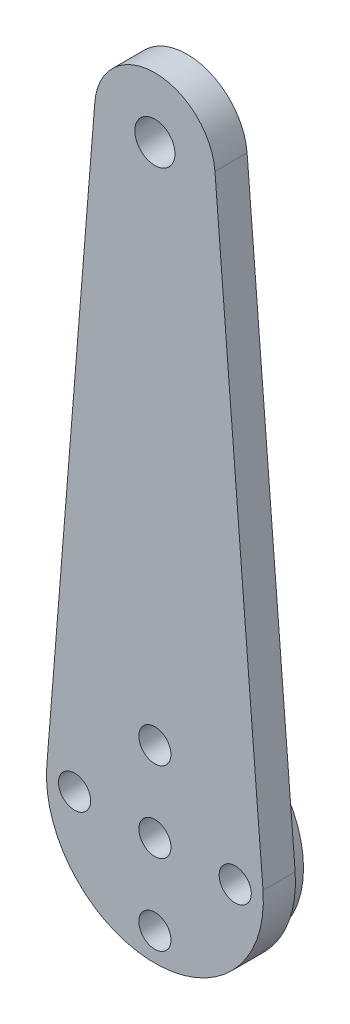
ISO-10303-21;
HEADER;
FILE_DESCRIPTION(('STEP AP214'),'2;1');
FILE_NAME('part.step','',(''),(''),'','','');
FILE_SCHEMA(('AUTOMOTIVE_DESIGN { 1 0 10303 214 1 1 1 1 }'));
ENDSEC;
DATA;
#1=APPLICATION_CONTEXT('core data for automotive mechanical design processes');
#2=APPLICATION_PROTOCOL_DEFINITION('international standard','automotive_design',2000,#1);
#3=PRODUCT_CONTEXT('',#1,'mechanical');
#4=PRODUCT('Part','Part','',(#3));
#5=PRODUCT_RELATED_PRODUCT_CATEGORY('part','',(#4));
#6=PRODUCT_DEFINITION_FORMATION('','',#4);
#7=PRODUCT_DEFINITION_CONTEXT('part definition',#1,'design');
#8=PRODUCT_DEFINITION('design','',#6,#7);
#9=PRODUCT_DEFINITION_SHAPE('','',#8);
#10=(LENGTH_UNIT() NAMED_UNIT(*) SI_UNIT(.MILLI.,.METRE.));
#11=(NAMED_UNIT(*) PLANE_ANGLE_UNIT() SI_UNIT($,.RADIAN.));
#12=(NAMED_UNIT(*) SI_UNIT($,.STERADIAN.) SOLID_ANGLE_UNIT());
#13=UNCERTAINTY_MEASURE_WITH_UNIT(LENGTH_MEASURE(1.E-05),#10,'distance_accuracy_value','');
#14=(GEOMETRIC_REPRESENTATION_CONTEXT(3) GLOBAL_UNCERTAINTY_ASSIGNED_CONTEXT((#13)) GLOBAL_UNIT_ASSIGNED_CONTEXT((#10,
#11,#12)) REPRESENTATION_CONTEXT('',''));
#15=CARTESIAN_POINT('',(0.,0.,0.));
#16=DIRECTION('',(0.,0.,1.));
#17=DIRECTION('',(1.,0.,0.));
#18=AXIS2_PLACEMENT_3D('',#15,#16,#17);
#19=CARTESIAN_POINT('',(0.,75.,6.));
#20=DIRECTION('',(0.,0.,1.));
#21=DIRECTION('',(1.,0.,0.));
#22=AXIS2_PLACEMENT_3D('',#19,#20,#21);
#23=PLANE('',#22);
#24=CARTESIAN_POINT('',(0.,75.,6.));
#25=DIRECTION('',(0.,0.,1.));
#26=DIRECTION('',(1.,0.,0.));
#27=AXIS2_PLACEMENT_3D('',#24,#25,#26);
#28=CIRCLE('',#27,2.5);
#29=CARTESIAN_POINT('',(2.5,75.,6.));
#30=VERTEX_POINT('',#29);
#31=EDGE_CURVE('E287',#30,#30,#28,.T.);
#32=ORIENTED_EDGE('',*,*,#31,.F.);
#33=EDGE_LOOP('',(#32));
#34=FACE_BOUND('',#33,.T.);
#35=CARTESIAN_POINT('',(-10.,0.,6.));
#36=DIRECTION('',(0.,0.,1.));
#37=DIRECTION('',(1.,0.,0.));
#38=AXIS2_PLACEMENT_3D('',#35,#36,#37);
#39=CIRCLE('',#38,2.);
#40=CARTESIAN_POINT('',(-8.,0.,6.));
#41=VERTEX_POINT('',#40);
#42=EDGE_CURVE('E141',#41,#41,#39,.T.);
#43=ORIENTED_EDGE('',*,*,#42,.F.);
#44=EDGE_LOOP('',(#43));
#45=FACE_BOUND('',#44,.T.);
#46=CARTESIAN_POINT('',(10.,0.,6.));
#47=DIRECTION('',(0.,0.,1.));
#48=DIRECTION('',(1.,0.,0.));
#49=AXIS2_PLACEMENT_3D('',#46,#47,#48);
#50=CIRCLE('',#49,2.);
#51=CARTESIAN_POINT('',(12.,0.,6.));
#52=VERTEX_POINT('',#51);
#53=EDGE_CURVE('E142',#52,#52,#50,.T.);
#54=ORIENTED_EDGE('',*,*,#53,.F.);
#55=EDGE_LOOP('',(#54));
#56=FACE_BOUND('',#55,.T.);
#57=CARTESIAN_POINT('',(0.,75.,6.));
#58=DIRECTION('',(0.,0.,1.));
#59=DIRECTION('',(1.,0.,0.));
#60=AXIS2_PLACEMENT_3D('',#57,#58,#59);
#61=CIRCLE('',#60,7.5);
#62=CARTESIAN_POINT('',(7.47596147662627,75.6,6.));
#63=VERTEX_POINT('',#62);
#64=CARTESIAN_POINT('',(-7.47596147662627,75.6,6.));
#65=VERTEX_POINT('',#64);
#66=EDGE_CURVE('E104',#63,#65,#61,.T.);
#67=ORIENTED_EDGE('',*,*,#66,.T.);
#68=DIRECTION('',(-0.08,-0.996794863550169,0.));
#69=VECTOR('',#68,1.);
#70=CARTESIAN_POINT('',(-7.47596147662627,75.6,6.));
#71=LINE('',#70,#69);
#72=CARTESIAN_POINT('',(-13.4567306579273,1.08,6.));
#73=VERTEX_POINT('',#72);
#74=EDGE_CURVE('E99',#65,#73,#71,.T.);
#75=ORIENTED_EDGE('',*,*,#74,.T.);
#76=CARTESIAN_POINT('',(0.,0.,6.));
#77=DIRECTION('',(0.,0.,1.));
#78=DIRECTION('',(1.,0.,0.));
#79=AXIS2_PLACEMENT_3D('',#76,#77,#78);
#80=CIRCLE('',#79,13.5);
#81=CARTESIAN_POINT('',(13.4567306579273,1.08,6.));
#82=VERTEX_POINT('',#81);
#83=EDGE_CURVE('E102',#73,#82,#80,.T.);
#84=ORIENTED_EDGE('',*,*,#83,.T.);
#85=DIRECTION('',(-0.08,0.996794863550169,0.));
#86=VECTOR('',#85,1.);
#87=CARTESIAN_POINT('',(7.47596147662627,75.6,6.));
#88=LINE('',#87,#86);
#89=EDGE_CURVE('E69',#82,#63,#88,.T.);
#90=ORIENTED_EDGE('',*,*,#89,.T.);
#91=EDGE_LOOP('',(#67,#75,#84,#90));
#92=FACE_BOUND('',#91,.T.);
#93=CARTESIAN_POINT('',(0.,-10.,6.));
#94=DIRECTION('',(0.,0.,1.));
#95=DIRECTION('',(1.,0.,0.));
#96=AXIS2_PLACEMENT_3D('',#93,#94,#95);
#97=CIRCLE('',#96,2.);
#98=CARTESIAN_POINT('',(2.,-10.,6.));
#99=VERTEX_POINT('',#98);
#100=EDGE_CURVE('E129',#99,#99,#97,.T.);
#101=ORIENTED_EDGE('',*,*,#100,.F.);
#102=EDGE_LOOP('',(#101));
#103=FACE_BOUND('',#102,.T.);
#104=CARTESIAN_POINT('',(0.,10.,6.));
#105=DIRECTION('',(0.,0.,1.));
#106=DIRECTION('',(1.,0.,0.));
#107=AXIS2_PLACEMENT_3D('',#104,#105,#106);
#108=CIRCLE('',#107,2.);
#109=CARTESIAN_POINT('',(2.,10.,6.));
#110=VERTEX_POINT('',#109);
#111=EDGE_CURVE('E294',#110,#110,#108,.T.);
#112=ORIENTED_EDGE('',*,*,#111,.F.);
#113=EDGE_LOOP('',(#112));
#114=FACE_BOUND('',#113,.T.);
#115=CARTESIAN_POINT('',(0.,0.,6.));
#116=DIRECTION('',(0.,0.,1.));
#117=DIRECTION('',(1.,0.,0.));
#118=AXIS2_PLACEMENT_3D('',#115,#116,#117);
#119=CIRCLE('',#118,2.);
#120=CARTESIAN_POINT('',(2.,0.,6.));
#121=VERTEX_POINT('',#120);
#122=EDGE_CURVE('E277',#121,#121,#119,.T.);
#123=ORIENTED_EDGE('',*,*,#122,.F.);
#124=EDGE_LOOP('',(#123));
#125=FACE_BOUND('',#124,.T.);
#126=ADVANCED_FACE('F52',(#34,#45,#56,#92,#103,#114,#125),#23,.T.);
#127=CARTESIAN_POINT('',(0.,75.,2.));
#128=DIRECTION('',(0.,0.,1.));
#129=DIRECTION('',(1.,0.,0.));
#130=AXIS2_PLACEMENT_3D('',#127,#128,#129);
#131=PLANE('',#130);
#132=CARTESIAN_POINT('',(0.,75.,2.));
#133=DIRECTION('',(0.,0.,1.));
#134=DIRECTION('',(1.,0.,0.));
#135=AXIS2_PLACEMENT_3D('',#132,#133,#134);
#136=CIRCLE('',#135,7.5);
#137=CARTESIAN_POINT('',(7.47596147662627,75.6,2.));
#138=VERTEX_POINT('',#137);
#139=CARTESIAN_POINT('',(-7.47596147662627,75.6,2.));
#140=VERTEX_POINT('',#139);
#141=EDGE_CURVE('E147',#138,#140,#136,.T.);
#142=ORIENTED_EDGE('',*,*,#141,.F.);
#143=DIRECTION('',(-0.08,0.996794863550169,0.));
#144=VECTOR('',#143,1.);
#145=CARTESIAN_POINT('',(7.47596147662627,75.6,2.));
#146=LINE('',#145,#144);
#147=CARTESIAN_POINT('',(13.4567306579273,1.08,2.));
#148=VERTEX_POINT('',#147);
#149=EDGE_CURVE('E92',#148,#138,#146,.T.);
#150=ORIENTED_EDGE('',*,*,#149,.F.);
#151=CARTESIAN_POINT('',(0.,0.,2.));
#152=DIRECTION('',(0.,0.,1.));
#153=DIRECTION('',(1.,0.,0.));
#154=AXIS2_PLACEMENT_3D('',#151,#152,#153);
#155=CIRCLE('',#154,13.5);
#156=CARTESIAN_POINT('',(-13.4567306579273,1.08,2.));
#157=VERTEX_POINT('',#156);
#158=EDGE_CURVE('E86',#157,#148,#155,.T.);
#159=ORIENTED_EDGE('',*,*,#158,.F.);
#160=DIRECTION('',(-0.08,-0.996794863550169,0.));
#161=VECTOR('',#160,1.);
#162=CARTESIAN_POINT('',(-7.47596147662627,75.6,2.));
#163=LINE('',#162,#161);
#164=EDGE_CURVE('E109',#140,#157,#163,.T.);
#165=ORIENTED_EDGE('',*,*,#164,.F.);
#166=EDGE_LOOP('',(#142,#150,#159,#165));
#167=FACE_BOUND('',#166,.T.);
#168=CARTESIAN_POINT('',(10.,0.,2.));
#169=DIRECTION('',(0.,0.,1.));
#170=DIRECTION('',(1.,0.,0.));
#171=AXIS2_PLACEMENT_3D('',#168,#169,#170);
#172=CIRCLE('',#171,2.);
#173=CARTESIAN_POINT('',(12.,0.,2.));
#174=VERTEX_POINT('',#173);
#175=EDGE_CURVE('E135',#174,#174,#172,.T.);
#176=ORIENTED_EDGE('',*,*,#175,.T.);
#177=EDGE_LOOP('',(#176));
#178=FACE_BOUND('',#177,.T.);
#179=CARTESIAN_POINT('',(0.,-10.,2.));
#180=DIRECTION('',(0.,0.,1.));
#181=DIRECTION('',(1.,0.,0.));
#182=AXIS2_PLACEMENT_3D('',#179,#180,#181);
#183=CIRCLE('',#182,2.);
#184=CARTESIAN_POINT('',(2.,-10.,2.));
#185=VERTEX_POINT('',#184);
#186=EDGE_CURVE('E136',#185,#185,#183,.T.);
#187=ORIENTED_EDGE('',*,*,#186,.T.);
#188=EDGE_LOOP('',(#187));
#189=FACE_BOUND('',#188,.T.);
#190=CARTESIAN_POINT('',(-10.,0.,2.));
#191=DIRECTION('',(0.,0.,1.));
#192=DIRECTION('',(1.,0.,0.));
#193=AXIS2_PLACEMENT_3D('',#190,#191,#192);
#194=CIRCLE('',#193,2.);
#195=CARTESIAN_POINT('',(-8.,0.,2.));
#196=VERTEX_POINT('',#195);
#197=EDGE_CURVE('E137',#196,#196,#194,.T.);
#198=ORIENTED_EDGE('',*,*,#197,.T.);
#199=EDGE_LOOP('',(#198));
#200=FACE_BOUND('',#199,.T.);
#201=CARTESIAN_POINT('',(0.,10.,2.));
#202=DIRECTION('',(0.,0.,1.));
#203=DIRECTION('',(1.,0.,0.));
#204=AXIS2_PLACEMENT_3D('',#201,#202,#203);
#205=CIRCLE('',#204,2.);
#206=CARTESIAN_POINT('',(2.,10.,2.));
#207=VERTEX_POINT('',#206);
#208=EDGE_CURVE('E292',#207,#207,#205,.T.);
#209=ORIENTED_EDGE('',*,*,#208,.T.);
#210=EDGE_LOOP('',(#209));
#211=FACE_BOUND('',#210,.T.);
#212=CARTESIAN_POINT('',(0.,75.,2.));
#213=DIRECTION('',(0.,0.,1.));
#214=DIRECTION('',(1.,0.,0.));
#215=AXIS2_PLACEMENT_3D('',#212,#213,#214);
#216=CIRCLE('',#215,2.5);
#217=CARTESIAN_POINT('',(2.5,75.,2.));
#218=VERTEX_POINT('',#217);
#219=EDGE_CURVE('E284',#218,#218,#216,.T.);
#220=ORIENTED_EDGE('',*,*,#219,.T.);
#221=EDGE_LOOP('',(#220));
#222=FACE_BOUND('',#221,.T.);
#223=CARTESIAN_POINT('',(0.,0.,2.));
#224=DIRECTION('',(0.,0.,1.));
#225=DIRECTION('',(1.,0.,0.));
#226=AXIS2_PLACEMENT_3D('',#223,#224,#225);
#227=CIRCLE('',#226,2.);
#228=CARTESIAN_POINT('',(2.,0.,2.));
#229=VERTEX_POINT('',#228);
#230=EDGE_CURVE('E280',#229,#229,#227,.T.);
#231=ORIENTED_EDGE('',*,*,#230,.T.);
#232=EDGE_LOOP('',(#231));
#233=FACE_BOUND('',#232,.T.);
#234=ADVANCED_FACE('F161',(#167,#178,#189,#200,#211,#222,#233),#131,.F.);
#235=CARTESIAN_POINT('',(0.,75.,6.));
#236=DIRECTION('',(0.,0.,-1.));
#237=DIRECTION('',(-1.,0.,0.));
#238=AXIS2_PLACEMENT_3D('',#235,#236,#237);
#239=CYLINDRICAL_SURFACE('',#238,7.5);
#240=ORIENTED_EDGE('',*,*,#141,.T.);
#241=DIRECTION('',(0.,0.,-1.));
#242=VECTOR('',#241,1.);
#243=CARTESIAN_POINT('',(-7.47596147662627,75.6,6.));
#244=LINE('',#243,#242);
#245=EDGE_CURVE('E13',#65,#140,#244,.T.);
#246=ORIENTED_EDGE('',*,*,#245,.F.);
#247=ORIENTED_EDGE('',*,*,#66,.F.);
#248=DIRECTION('',(0.,0.,-1.));
#249=VECTOR('',#248,1.);
#250=CARTESIAN_POINT('',(7.47596147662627,75.6,6.));
#251=LINE('',#250,#249);
#252=EDGE_CURVE('E115',#63,#138,#251,.T.);
#253=ORIENTED_EDGE('',*,*,#252,.T.);
#254=EDGE_LOOP('',(#240,#246,#247,#253));
#255=FACE_BOUND('',#254,.T.);
#256=ADVANCED_FACE('F54',(#255),#239,.T.);
#257=CARTESIAN_POINT('',(-7.47596147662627,75.6,6.));
#258=DIRECTION('',(0.996794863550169,-0.08,0.));
#259=DIRECTION('',(0.08,0.996794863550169,0.));
#260=AXIS2_PLACEMENT_3D('',#257,#258,#259);
#261=PLANE('',#260);
#262=ORIENTED_EDGE('',*,*,#164,.T.);
#263=DIRECTION('',(0.,0.,-1.));
#264=VECTOR('',#263,1.);
#265=CARTESIAN_POINT('',(-13.4567306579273,1.08,6.));
#266=LINE('',#265,#264);
#267=EDGE_CURVE('E61',#73,#157,#266,.T.);
#268=ORIENTED_EDGE('',*,*,#267,.F.);
#269=ORIENTED_EDGE('',*,*,#74,.F.);
#270=ORIENTED_EDGE('',*,*,#245,.T.);
#271=EDGE_LOOP('',(#262,#268,#269,#270));
#272=FACE_BOUND('',#271,.T.);
#273=ADVANCED_FACE('F108',(#272),#261,.F.);
#274=CARTESIAN_POINT('',(0.,0.,6.));
#275=DIRECTION('',(0.,0.,-1.));
#276=DIRECTION('',(-1.,0.,0.));
#277=AXIS2_PLACEMENT_3D('',#274,#275,#276);
#278=CYLINDRICAL_SURFACE('',#277,13.5);
#279=ORIENTED_EDGE('',*,*,#158,.T.);
#280=DIRECTION('',(0.,0.,-1.));
#281=VECTOR('',#280,1.);
#282=CARTESIAN_POINT('',(13.4567306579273,1.08,6.));
#283=LINE('',#282,#281);
#284=EDGE_CURVE('E110',#82,#148,#283,.T.);
#285=ORIENTED_EDGE('',*,*,#284,.F.);
#286=ORIENTED_EDGE('',*,*,#83,.F.);
#287=ORIENTED_EDGE('',*,*,#267,.T.);
#288=EDGE_LOOP('',(#279,#285,#286,#287));
#289=FACE_BOUND('',#288,.T.);
#290=ADVANCED_FACE('F111',(#289),#278,.T.);
#291=CARTESIAN_POINT('',(7.47596147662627,75.6,6.));
#292=DIRECTION('',(-0.996794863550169,-0.08,0.));
#293=DIRECTION('',(0.08,-0.996794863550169,0.));
#294=AXIS2_PLACEMENT_3D('',#291,#292,#293);
#295=PLANE('',#294);
#296=ORIENTED_EDGE('',*,*,#149,.T.);
#297=ORIENTED_EDGE('',*,*,#252,.F.);
#298=ORIENTED_EDGE('',*,*,#89,.F.);
#299=ORIENTED_EDGE('',*,*,#284,.T.);
#300=EDGE_LOOP('',(#296,#297,#298,#299));
#301=FACE_BOUND('',#300,.T.);
#302=ADVANCED_FACE('F158',(#301),#295,.F.);
#303=CARTESIAN_POINT('',(10.,0.,6.));
#304=DIRECTION('',(0.,0.,-1.));
#305=DIRECTION('',(-1.,0.,0.));
#306=AXIS2_PLACEMENT_3D('',#303,#304,#305);
#307=CYLINDRICAL_SURFACE('',#306,2.);
#308=ORIENTED_EDGE('',*,*,#53,.T.);
#309=EDGE_LOOP('',(#308));
#310=FACE_BOUND('',#309,.T.);
#311=ORIENTED_EDGE('',*,*,#175,.F.);
#312=EDGE_LOOP('',(#311));
#313=FACE_BOUND('',#312,.T.);
#314=ADVANCED_FACE('F179',(#310,#313),#307,.F.);
#315=CARTESIAN_POINT('',(0.,-10.,6.));
#316=DIRECTION('',(0.,0.,-1.));
#317=DIRECTION('',(-1.,0.,0.));
#318=AXIS2_PLACEMENT_3D('',#315,#316,#317);
#319=CYLINDRICAL_SURFACE('',#318,2.);
#320=ORIENTED_EDGE('',*,*,#100,.T.);
#321=EDGE_LOOP('',(#320));
#322=FACE_BOUND('',#321,.T.);
#323=ORIENTED_EDGE('',*,*,#186,.F.);
#324=EDGE_LOOP('',(#323));
#325=FACE_BOUND('',#324,.T.);
#326=ADVANCED_FACE('F199',(#322,#325),#319,.F.);
#327=CARTESIAN_POINT('',(-10.,0.,6.));
#328=DIRECTION('',(0.,0.,-1.));
#329=DIRECTION('',(-1.,0.,0.));
#330=AXIS2_PLACEMENT_3D('',#327,#328,#329);
#331=CYLINDRICAL_SURFACE('',#330,2.);
#332=ORIENTED_EDGE('',*,*,#42,.T.);
#333=EDGE_LOOP('',(#332));
#334=FACE_BOUND('',#333,.T.);
#335=ORIENTED_EDGE('',*,*,#197,.F.);
#336=EDGE_LOOP('',(#335));
#337=FACE_BOUND('',#336,.T.);
#338=ADVANCED_FACE('F206',(#334,#337),#331,.F.);
#339=CARTESIAN_POINT('',(0.,10.,6.));
#340=DIRECTION('',(0.,0.,-1.));
#341=DIRECTION('',(-1.,0.,0.));
#342=AXIS2_PLACEMENT_3D('',#339,#340,#341);
#343=CYLINDRICAL_SURFACE('',#342,2.);
#344=ORIENTED_EDGE('',*,*,#111,.T.);
#345=EDGE_LOOP('',(#344));
#346=FACE_BOUND('',#345,.T.);
#347=ORIENTED_EDGE('',*,*,#208,.F.);
#348=EDGE_LOOP('',(#347));
#349=FACE_BOUND('',#348,.T.);
#350=ADVANCED_FACE('F213',(#346,#349),#343,.F.);
#351=CARTESIAN_POINT('',(0.,75.,6.));
#352=DIRECTION('',(0.,0.,-1.));
#353=DIRECTION('',(-1.,0.,0.));
#354=AXIS2_PLACEMENT_3D('',#351,#352,#353);
#355=CYLINDRICAL_SURFACE('',#354,2.5);
#356=ORIENTED_EDGE('',*,*,#31,.T.);
#357=EDGE_LOOP('',(#356));
#358=FACE_BOUND('',#357,.T.);
#359=ORIENTED_EDGE('',*,*,#219,.F.);
#360=EDGE_LOOP('',(#359));
#361=FACE_BOUND('',#360,.T.);
#362=ADVANCED_FACE('F221',(#358,#361),#355,.F.);
#363=CARTESIAN_POINT('',(0.,0.,6.));
#364=DIRECTION('',(0.,0.,-1.));
#365=DIRECTION('',(-1.,0.,0.));
#366=AXIS2_PLACEMENT_3D('',#363,#364,#365);
#367=CYLINDRICAL_SURFACE('',#366,2.);
#368=ORIENTED_EDGE('',*,*,#122,.T.);
#369=EDGE_LOOP('',(#368));
#370=FACE_BOUND('',#369,.T.);
#371=ORIENTED_EDGE('',*,*,#230,.F.);
#372=EDGE_LOOP('',(#371));
#373=FACE_BOUND('',#372,.T.);
#374=ADVANCED_FACE('F229',(#370,#373),#367,.F.);
#375=CLOSED_SHELL('',(#126,#234,#256,#273,#290,#302,#314,#326,#338,#350,#362,#374));
#376=MANIFOLD_SOLID_BREP('B2',#375);
#377=CARTESIAN_POINT('',(0.,0.,0.));
#378=DIRECTION('',(0.,0.,1.));
#379=DIRECTION('',(1.,0.,0.));
#380=AXIS2_PLACEMENT_3D('',#377,#378,#379);
#381=PLANE('',#380);
#382=CARTESIAN_POINT('',(0.,0.,0.));
#383=DIRECTION('',(0.,0.,1.));
#384=DIRECTION('',(1.,0.,0.));
#385=AXIS2_PLACEMENT_3D('',#382,#383,#384);
#386=CIRCLE('',#385,2.);
#387=CARTESIAN_POINT('',(2.,0.,0.));
#388=VERTEX_POINT('',#387);
#389=EDGE_CURVE('E362',#388,#388,#386,.T.);
#390=ORIENTED_EDGE('',*,*,#389,.T.);
#391=EDGE_LOOP('',(#390));
#392=FACE_BOUND('',#391,.T.);
#393=CARTESIAN_POINT('',(0.,0.,0.));
#394=DIRECTION('',(0.,0.,-1.));
#395=DIRECTION('',(-1.,0.,0.));
#396=AXIS2_PLACEMENT_3D('',#393,#394,#395);
#397=CIRCLE('',#396,3.5);
#398=CARTESIAN_POINT('',(-3.5,0.,0.));
#399=VERTEX_POINT('',#398);
#400=EDGE_CURVE('E407',#399,#399,#397,.T.);
#401=ORIENTED_EDGE('',*,*,#400,.T.);
#402=EDGE_LOOP('',(#401));
#403=FACE_BOUND('',#402,.T.);
#404=ADVANCED_FACE('F329',(#392,#403),#381,.F.);
#405=CARTESIAN_POINT('',(0.,0.,2.));
#406=DIRECTION('',(0.,0.,-1.));
#407=DIRECTION('',(-1.,0.,0.));
#408=AXIS2_PLACEMENT_3D('',#405,#406,#407);
#409=CYLINDRICAL_SURFACE('',#408,2.);
#410=CARTESIAN_POINT('',(0.,0.,2.));
#411=DIRECTION('',(0.,0.,1.));
#412=DIRECTION('',(1.,0.,0.));
#413=AXIS2_PLACEMENT_3D('',#410,#411,#412);
#414=CIRCLE('',#413,2.);
#415=CARTESIAN_POINT('',(2.,0.,2.));
#416=VERTEX_POINT('',#415);
#417=EDGE_CURVE('E340',#416,#416,#414,.T.);
#418=ORIENTED_EDGE('',*,*,#417,.T.);
#419=EDGE_LOOP('',(#418));
#420=FACE_BOUND('',#419,.T.);
#421=ORIENTED_EDGE('',*,*,#389,.F.);
#422=EDGE_LOOP('',(#421));
#423=FACE_BOUND('',#422,.T.);
#424=ADVANCED_FACE('F396',(#420,#423),#409,.F.);
#425=CARTESIAN_POINT('',(0.,10.,2.));
#426=DIRECTION('',(0.,0.,-1.));
#427=DIRECTION('',(-1.,0.,0.));
#428=AXIS2_PLACEMENT_3D('',#425,#426,#427);
#429=CYLINDRICAL_SURFACE('',#428,2.);
#430=CARTESIAN_POINT('',(0.,10.,2.));
#431=DIRECTION('',(0.,0.,1.));
#432=DIRECTION('',(1.,0.,0.));
#433=AXIS2_PLACEMENT_3D('',#430,#431,#432);
#434=CIRCLE('',#433,2.);
#435=CARTESIAN_POINT('',(2.,10.,2.));
#436=VERTEX_POINT('',#435);
#437=EDGE_CURVE('E345',#436,#436,#434,.T.);
#438=ORIENTED_EDGE('',*,*,#437,.T.);
#439=EDGE_LOOP('',(#438));
#440=FACE_BOUND('',#439,.T.);
#441=CARTESIAN_POINT('',(0.,10.,0.));
#442=DIRECTION('',(0.,0.,1.));
#443=DIRECTION('',(1.,0.,0.));
#444=AXIS2_PLACEMENT_3D('',#441,#442,#443);
#445=CIRCLE('',#444,2.);
#446=CARTESIAN_POINT('',(2.,10.,0.));
#447=VERTEX_POINT('',#446);
#448=EDGE_CURVE('E359',#447,#447,#445,.T.);
#449=ORIENTED_EDGE('',*,*,#448,.F.);
#450=EDGE_LOOP('',(#449));
#451=FACE_BOUND('',#450,.T.);
#452=ADVANCED_FACE('F384',(#440,#451),#429,.F.);
#453=CARTESIAN_POINT('',(10.,0.,2.));
#454=DIRECTION('',(0.,0.,-1.));
#455=DIRECTION('',(-1.,0.,0.));
#456=AXIS2_PLACEMENT_3D('',#453,#454,#455);
#457=CYLINDRICAL_SURFACE('',#456,2.);
#458=CARTESIAN_POINT('',(10.,0.,2.));
#459=DIRECTION('',(0.,0.,1.));
#460=DIRECTION('',(1.,0.,0.));
#461=AXIS2_PLACEMENT_3D('',#458,#459,#460);
#462=CIRCLE('',#461,2.);
#463=CARTESIAN_POINT('',(12.,0.,2.));
#464=VERTEX_POINT('',#463);
#465=EDGE_CURVE('E375',#464,#464,#462,.T.);
#466=ORIENTED_EDGE('',*,*,#465,.T.);
#467=EDGE_LOOP('',(#466));
#468=FACE_BOUND('',#467,.T.);
#469=CARTESIAN_POINT('',(10.,0.,0.));
#470=DIRECTION('',(0.,0.,1.));
#471=DIRECTION('',(1.,0.,0.));
#472=AXIS2_PLACEMENT_3D('',#469,#470,#471);
#473=CIRCLE('',#472,2.);
#474=CARTESIAN_POINT('',(12.,0.,0.));
#475=VERTEX_POINT('',#474);
#476=EDGE_CURVE('E356',#475,#475,#473,.T.);
#477=ORIENTED_EDGE('',*,*,#476,.F.);
#478=EDGE_LOOP('',(#477));
#479=FACE_BOUND('',#478,.T.);
#480=ADVANCED_FACE('F438',(#468,#479),#457,.F.);
#481=CARTESIAN_POINT('',(0.,-10.,2.));
#482=DIRECTION('',(0.,0.,-1.));
#483=DIRECTION('',(-1.,0.,0.));
#484=AXIS2_PLACEMENT_3D('',#481,#482,#483);
#485=CYLINDRICAL_SURFACE('',#484,2.);
#486=CARTESIAN_POINT('',(0.,-10.,2.));
#487=DIRECTION('',(0.,0.,1.));
#488=DIRECTION('',(1.,0.,0.));
#489=AXIS2_PLACEMENT_3D('',#486,#487,#488);
#490=CIRCLE('',#489,2.);
#491=CARTESIAN_POINT('',(2.,-10.,2.));
#492=VERTEX_POINT('',#491);
#493=EDGE_CURVE('E370',#492,#492,#490,.T.);
#494=ORIENTED_EDGE('',*,*,#493,.T.);
#495=EDGE_LOOP('',(#494));
#496=FACE_BOUND('',#495,.T.);
#497=CARTESIAN_POINT('',(0.,-10.,0.));
#498=DIRECTION('',(0.,0.,1.));
#499=DIRECTION('',(1.,0.,0.));
#500=AXIS2_PLACEMENT_3D('',#497,#498,#499);
#501=CIRCLE('',#500,2.);
#502=CARTESIAN_POINT('',(2.,-10.,0.));
#503=VERTEX_POINT('',#502);
#504=EDGE_CURVE('E352',#503,#503,#501,.T.);
#505=ORIENTED_EDGE('',*,*,#504,.F.);
#506=EDGE_LOOP('',(#505));
#507=FACE_BOUND('',#506,.T.);
#508=ADVANCED_FACE('F440',(#496,#507),#485,.F.);
#509=CARTESIAN_POINT('',(-10.,0.,2.));
#510=DIRECTION('',(0.,0.,-1.));
#511=DIRECTION('',(-1.,0.,0.));
#512=AXIS2_PLACEMENT_3D('',#509,#510,#511);
#513=CYLINDRICAL_SURFACE('',#512,2.);
#514=CARTESIAN_POINT('',(-10.,0.,2.));
#515=DIRECTION('',(0.,0.,1.));
#516=DIRECTION('',(1.,0.,0.));
#517=AXIS2_PLACEMENT_3D('',#514,#515,#516);
#518=CIRCLE('',#517,2.);
#519=CARTESIAN_POINT('',(-8.,0.,2.));
#520=VERTEX_POINT('',#519);
#521=EDGE_CURVE('E366',#520,#520,#518,.T.);
#522=ORIENTED_EDGE('',*,*,#521,.T.);
#523=EDGE_LOOP('',(#522));
#524=FACE_BOUND('',#523,.T.);
#525=CARTESIAN_POINT('',(-10.,0.,0.));
#526=DIRECTION('',(0.,0.,1.));
#527=DIRECTION('',(1.,0.,0.));
#528=AXIS2_PLACEMENT_3D('',#525,#526,#527);
#529=CIRCLE('',#528,2.);
#530=CARTESIAN_POINT('',(-8.,0.,0.));
#531=VERTEX_POINT('',#530);
#532=EDGE_CURVE('E349',#531,#531,#529,.T.);
#533=ORIENTED_EDGE('',*,*,#532,.F.);
#534=EDGE_LOOP('',(#533));
#535=FACE_BOUND('',#534,.T.);
#536=ADVANCED_FACE('F331',(#524,#535),#513,.F.);
#537=CARTESIAN_POINT('',(0.,0.,2.));
#538=DIRECTION('',(0.,0.,-1.));
#539=DIRECTION('',(-1.,0.,0.));
#540=AXIS2_PLACEMENT_3D('',#537,#538,#539);
#541=CYLINDRICAL_SURFACE('',#540,12.5);
#542=CARTESIAN_POINT('',(0.,0.,2.));
#543=DIRECTION('',(0.,0.,1.));
#544=DIRECTION('',(1.,0.,0.));
#545=AXIS2_PLACEMENT_3D('',#542,#543,#544);
#546=CIRCLE('',#545,12.5);
#547=CARTESIAN_POINT('',(12.5,0.,2.));
#548=VERTEX_POINT('',#547);
#549=EDGE_CURVE('E336',#548,#548,#546,.T.);
#550=ORIENTED_EDGE('',*,*,#549,.F.);
#551=EDGE_LOOP('',(#550));
#552=FACE_BOUND('',#551,.T.);
#553=CARTESIAN_POINT('',(0.,0.,0.));
#554=DIRECTION('',(0.,0.,1.));
#555=DIRECTION('',(1.,0.,0.));
#556=AXIS2_PLACEMENT_3D('',#553,#554,#555);
#557=CIRCLE('',#556,12.5);
#558=CARTESIAN_POINT('',(12.5,0.,0.));
#559=VERTEX_POINT('',#558);
#560=EDGE_CURVE('E364',#559,#559,#557,.T.);
#561=ORIENTED_EDGE('',*,*,#560,.T.);
#562=EDGE_LOOP('',(#561));
#563=FACE_BOUND('',#562,.T.);
#564=ADVANCED_FACE('F391',(#552,#563),#541,.T.);
#565=CARTESIAN_POINT('',(0.,0.,2.));
#566=DIRECTION('',(0.,0.,1.));
#567=DIRECTION('',(1.,0.,0.));
#568=AXIS2_PLACEMENT_3D('',#565,#566,#567);
#569=PLANE('',#568);
#570=ORIENTED_EDGE('',*,*,#521,.F.);
#571=EDGE_LOOP('',(#570));
#572=FACE_BOUND('',#571,.T.);
#573=ORIENTED_EDGE('',*,*,#493,.F.);
#574=EDGE_LOOP('',(#573));
#575=FACE_BOUND('',#574,.T.);
#576=ORIENTED_EDGE('',*,*,#465,.F.);
#577=EDGE_LOOP('',(#576));
#578=FACE_BOUND('',#577,.T.);
#579=ORIENTED_EDGE('',*,*,#437,.F.);
#580=EDGE_LOOP('',(#579));
#581=FACE_BOUND('',#580,.T.);
#582=ORIENTED_EDGE('',*,*,#417,.F.);
#583=EDGE_LOOP('',(#582));
#584=FACE_BOUND('',#583,.T.);
#585=ORIENTED_EDGE('',*,*,#549,.T.);
#586=EDGE_LOOP('',(#585));
#587=FACE_BOUND('',#586,.T.);
#588=ADVANCED_FACE('F387',(#572,#575,#578,#581,#584,#587),#569,.T.);
#589=CARTESIAN_POINT('',(0.,0.,0.));
#590=DIRECTION('',(0.,0.,1.));
#591=DIRECTION('',(1.,0.,0.));
#592=AXIS2_PLACEMENT_3D('',#589,#590,#591);
#593=CIRCLE('',#592,4.5);
#594=CARTESIAN_POINT('',(4.5,0.,0.));
#595=VERTEX_POINT('',#594);
#596=EDGE_CURVE('E51',#595,#595,#593,.F.);
#597=ORIENTED_EDGE('',*,*,#596,.F.);
#598=EDGE_LOOP('',(#597));
#599=FACE_BOUND('',#598,.T.);
#600=ORIENTED_EDGE('',*,*,#532,.T.);
#601=EDGE_LOOP('',(#600));
#602=FACE_BOUND('',#601,.T.);
#603=ORIENTED_EDGE('',*,*,#504,.T.);
#604=EDGE_LOOP('',(#603));
#605=FACE_BOUND('',#604,.T.);
#606=ORIENTED_EDGE('',*,*,#476,.T.);
#607=EDGE_LOOP('',(#606));
#608=FACE_BOUND('',#607,.T.);
#609=ORIENTED_EDGE('',*,*,#448,.T.);
#610=EDGE_LOOP('',(#609));
#611=FACE_BOUND('',#610,.T.);
#612=ORIENTED_EDGE('',*,*,#560,.F.);
#613=EDGE_LOOP('',(#612));
#614=FACE_BOUND('',#613,.T.);
#615=ADVANCED_FACE('F390',(#599,#602,#605,#608,#611,#614),#381,.F.);
#616=CARTESIAN_POINT('',(0.,0.,-3.));
#617=DIRECTION('',(0.,0.,-1.));
#618=DIRECTION('',(-1.,0.,0.));
#619=AXIS2_PLACEMENT_3D('',#616,#617,#618);
#620=PLANE('',#619);
#621=CARTESIAN_POINT('',(0.,0.,-3.));
#622=DIRECTION('',(0.,0.,-1.));
#623=DIRECTION('',(-1.,0.,0.));
#624=AXIS2_PLACEMENT_3D('',#621,#622,#623);
#625=CIRCLE('',#624,4.5);
#626=CARTESIAN_POINT('',(-4.5,0.,-3.));
#627=VERTEX_POINT('',#626);
#628=EDGE_CURVE('E353',#627,#627,#625,.T.);
#629=ORIENTED_EDGE('',*,*,#628,.T.);
#630=EDGE_LOOP('',(#629));
#631=FACE_BOUND('',#630,.T.);
#632=CARTESIAN_POINT('',(0.,0.,-3.));
#633=DIRECTION('',(0.,0.,-1.));
#634=DIRECTION('',(-1.,0.,0.));
#635=AXIS2_PLACEMENT_3D('',#632,#633,#634);
#636=CIRCLE('',#635,3.5);
#637=CARTESIAN_POINT('',(-3.5,0.,-3.));
#638=VERTEX_POINT('',#637);
#639=EDGE_CURVE('E409',#638,#638,#636,.T.);
#640=ORIENTED_EDGE('',*,*,#639,.F.);
#641=EDGE_LOOP('',(#640));
#642=FACE_BOUND('',#641,.T.);
#643=ADVANCED_FACE('F417',(#631,#642),#620,.T.);
#644=CARTESIAN_POINT('',(0.,0.,-3.));
#645=DIRECTION('',(0.,0.,1.));
#646=DIRECTION('',(1.,0.,0.));
#647=AXIS2_PLACEMENT_3D('',#644,#645,#646);
#648=CYLINDRICAL_SURFACE('',#647,4.5);
#649=ORIENTED_EDGE('',*,*,#628,.F.);
#650=EDGE_LOOP('',(#649));
#651=FACE_BOUND('',#650,.T.);
#652=ORIENTED_EDGE('',*,*,#596,.T.);
#653=EDGE_LOOP('',(#652));
#654=FACE_BOUND('',#653,.T.);
#655=ADVANCED_FACE('F420',(#651,#654),#648,.T.);
#656=CARTESIAN_POINT('',(0.,0.,-3.));
#657=DIRECTION('',(0.,0.,1.));
#658=DIRECTION('',(1.,0.,0.));
#659=AXIS2_PLACEMENT_3D('',#656,#657,#658);
#660=CYLINDRICAL_SURFACE('',#659,3.5);
#661=ORIENTED_EDGE('',*,*,#639,.T.);
#662=EDGE_LOOP('',(#661));
#663=FACE_BOUND('',#662,.T.);
#664=ORIENTED_EDGE('',*,*,#400,.F.);
#665=EDGE_LOOP('',(#664));
#666=FACE_BOUND('',#665,.T.);
#667=ADVANCED_FACE('F422',(#663,#666),#660,.F.);
#668=CLOSED_SHELL('',(#404,#424,#452,#480,#508,#536,#564,#588,#615,#643,#655,#667));
#669=MANIFOLD_SOLID_BREP('B7',#668);
#670=ADVANCED_BREP_SHAPE_REPRESENTATION('',(#18,#376,#669),#14);
#671=SHAPE_DEFINITION_REPRESENTATION(#9,#670);
ENDSEC;
END-ISO-10303-21;
